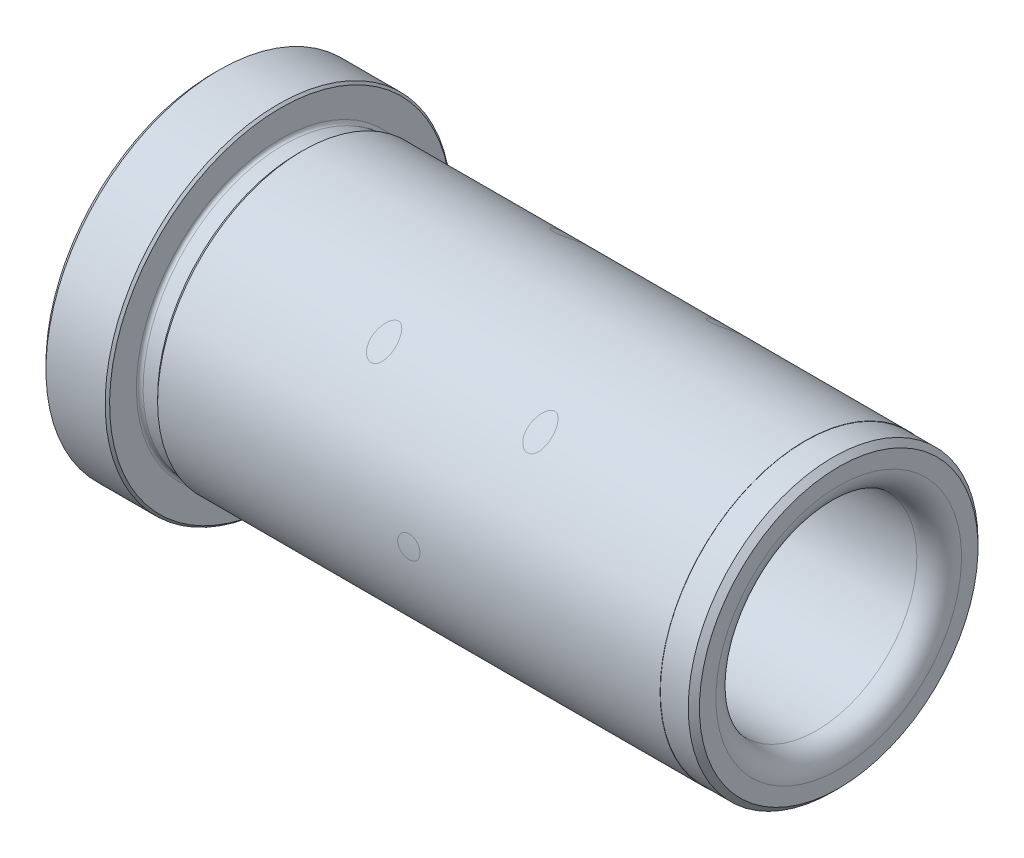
from build123d import *

# Parameters (mm, degrees)
SKETCH2_R      = 9
EXTRUDE1_DEPTH = 56
FILLET2_R      = 2
CHAMFER5_SIZE  = 0.2
CHAMFER3_SIZE  = 0.5
CHAMFER4_SIZE  = 0.5
CHAMFER7_SIZE  = 0.5


with BuildPart() as part:
    # Sketch1 → Revolve1 (revolve)
    with BuildSketch(Plane.XY):
        with BuildLine():
            Line((28, 12.975), (25, 12.975))
            Line((25, 12.975), (25, 13))
            Line((25, 13), (-20, 13))
            Line((-20, 13), (-20.4, 12.6))
            Line((-20.4, 12.6), (-21.7, 12.6))
            ThreePointArc((-21.7, 12.6), (-21.912132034, 12.687867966), (-22, 12.9))
            Line((-22, 12.9), (-22, 15.5))
            Line((-22, 15.5), (-28, 15.5))
            Line((-28, 15.5), (-28, 0))
            Line((-28, 0), (28, 0))
            Line((28, 0), (28, 12.975))
        make_face()
    revolve(axis=Axis((28, 0, 0), (-1, 0, 0)))

    # Sketch2 → Extrude1 (cut)
    with BuildSketch(Plane(origin=(28, 0, 0), x_dir=(0, 0, -1), z_dir=(1, 0, 0))):
        with Locations(Location((0, 0, 0), (0, 0, 90))):
            Circle(SKETCH2_R)
    extrude(amount=-EXTRUDE1_DEPTH, mode=Mode.SUBTRACT)

    # Fillet2
    fillet2_edges = [part.edges().sort_by_distance(p)[0] for p in [
        (28, -9, 0),
    ]]
    fillet(fillet2_edges, radius=FILLET2_R)

    # Chamfer5
    chamfer5_edges = [part.edges().sort_by_distance(p)[0] for p in [
        (-22, -15.5, 0),
    ]]
    chamfer(chamfer5_edges, length=CHAMFER5_SIZE)

    # Chamfer3
    chamfer3_edges = [part.edges().sort_by_distance(p)[0] for p in [
        (28, -12.975, 0),
    ]]
    chamfer(chamfer3_edges, length=CHAMFER3_SIZE)

    # Chamfer4
    chamfer4_edges = [part.edges().sort_by_distance(p)[0] for p in [
        (-28, -15.5, 0),
    ]]
    chamfer(chamfer4_edges, length=CHAMFER4_SIZE)

    # Chamfer7
    chamfer7_edges = [part.edges().sort_by_distance(p)[0] for p in [
        (-28, -9, 0),
    ]]
    chamfer(chamfer7_edges, length=CHAMFER7_SIZE)


solid = part.part
